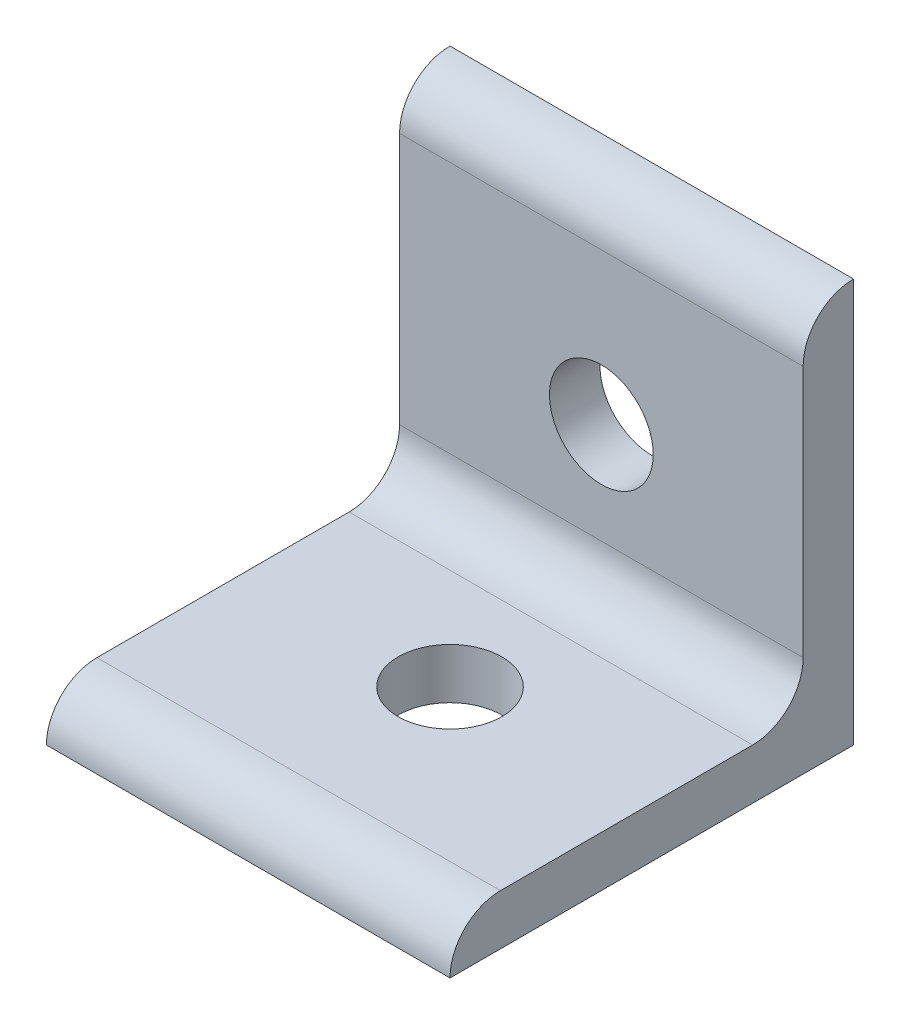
ISO-10303-21;
HEADER;
FILE_DESCRIPTION(('STEP AP214'),'2;1');
FILE_NAME('part.step','',(''),(''),'','','');
FILE_SCHEMA(('AUTOMOTIVE_DESIGN { 1 0 10303 214 1 1 1 1 }'));
ENDSEC;
DATA;
#1=APPLICATION_CONTEXT('core data for automotive mechanical design processes');
#2=APPLICATION_PROTOCOL_DEFINITION('international standard','automotive_design',2000,#1);
#3=PRODUCT_CONTEXT('',#1,'mechanical');
#4=PRODUCT('Part','Part','',(#3));
#5=PRODUCT_RELATED_PRODUCT_CATEGORY('part','',(#4));
#6=PRODUCT_DEFINITION_FORMATION('','',#4);
#7=PRODUCT_DEFINITION_CONTEXT('part definition',#1,'design');
#8=PRODUCT_DEFINITION('design','',#6,#7);
#9=PRODUCT_DEFINITION_SHAPE('','',#8);
#10=(LENGTH_UNIT() NAMED_UNIT(*) SI_UNIT(.MILLI.,.METRE.));
#11=(NAMED_UNIT(*) PLANE_ANGLE_UNIT() SI_UNIT($,.RADIAN.));
#12=(NAMED_UNIT(*) SI_UNIT($,.STERADIAN.) SOLID_ANGLE_UNIT());
#13=UNCERTAINTY_MEASURE_WITH_UNIT(LENGTH_MEASURE(1.E-05),#10,'distance_accuracy_value','');
#14=(GEOMETRIC_REPRESENTATION_CONTEXT(3) GLOBAL_UNCERTAINTY_ASSIGNED_CONTEXT((#13)) GLOBAL_UNIT_ASSIGNED_CONTEXT((#10,
#11,#12)) REPRESENTATION_CONTEXT('',''));
#15=CARTESIAN_POINT('',(0.,0.,0.));
#16=DIRECTION('',(0.,0.,1.));
#17=DIRECTION('',(1.,0.,0.));
#18=AXIS2_PLACEMENT_3D('',#15,#16,#17);
#19=CARTESIAN_POINT('',(12.7,0.,25.4));
#20=DIRECTION('',(0.,1.,0.));
#21=DIRECTION('',(0.,0.,1.));
#22=AXIS2_PLACEMENT_3D('',#19,#20,#21);
#23=PLANE('',#22);
#24=DIRECTION('',(-1.,0.,0.));
#25=VECTOR('',#24,1.);
#26=CARTESIAN_POINT('',(12.7,0.,25.4));
#27=LINE('',#26,#25);
#28=CARTESIAN_POINT('',(12.7,0.,25.4));
#29=VERTEX_POINT('',#28);
#30=CARTESIAN_POINT('',(-12.7,0.,25.4));
#31=VERTEX_POINT('',#30);
#32=EDGE_CURVE('E11',#29,#31,#27,.T.);
#33=ORIENTED_EDGE('',*,*,#32,.T.);
#34=DIRECTION('',(0.,0.,-1.));
#35=VECTOR('',#34,1.);
#36=CARTESIAN_POINT('',(-12.7,0.,25.4));
#37=LINE('',#36,#35);
#38=CARTESIAN_POINT('',(-12.7,0.,0.));
#39=VERTEX_POINT('',#38);
#40=EDGE_CURVE('E96',#31,#39,#37,.T.);
#41=ORIENTED_EDGE('',*,*,#40,.T.);
#42=DIRECTION('',(-1.,0.,0.));
#43=VECTOR('',#42,1.);
#44=CARTESIAN_POINT('',(12.7,0.,0.));
#45=LINE('',#44,#43);
#46=CARTESIAN_POINT('',(12.7,0.,0.));
#47=VERTEX_POINT('',#46);
#48=EDGE_CURVE('E43',#47,#39,#45,.T.);
#49=ORIENTED_EDGE('',*,*,#48,.F.);
#50=DIRECTION('',(0.,0.,-1.));
#51=VECTOR('',#50,1.);
#52=CARTESIAN_POINT('',(12.7,0.,25.4));
#53=LINE('',#52,#51);
#54=EDGE_CURVE('E97',#29,#47,#53,.T.);
#55=ORIENTED_EDGE('',*,*,#54,.F.);
#56=EDGE_LOOP('',(#33,#41,#49,#55));
#57=FACE_BOUND('',#56,.T.);
#58=CARTESIAN_POINT('',(0.,0.,12.7));
#59=DIRECTION('',(0.,1.,0.));
#60=DIRECTION('',(0.,0.,1.));
#61=AXIS2_PLACEMENT_3D('',#58,#59,#60);
#62=CIRCLE('',#61,3.2639);
#63=CARTESIAN_POINT('',(0.,0.,15.9639));
#64=VERTEX_POINT('',#63);
#65=EDGE_CURVE('E179',#64,#64,#62,.T.);
#66=ORIENTED_EDGE('',*,*,#65,.T.);
#67=EDGE_LOOP('',(#66));
#68=FACE_BOUND('',#67,.T.);
#69=ADVANCED_FACE('F35',(#57,#68),#23,.F.);
#70=CARTESIAN_POINT('',(12.7,3.175,6.35));
#71=DIRECTION('',(0.,-1.,0.));
#72=DIRECTION('',(0.,0.,-1.));
#73=AXIS2_PLACEMENT_3D('',#70,#71,#72);
#74=PLANE('',#73);
#75=DIRECTION('',(-1.,0.,0.));
#76=VECTOR('',#75,1.);
#77=CARTESIAN_POINT('',(12.7,3.175,6.35));
#78=LINE('',#77,#76);
#79=CARTESIAN_POINT('',(12.7,3.175,6.35));
#80=VERTEX_POINT('',#79);
#81=CARTESIAN_POINT('',(-12.7,3.175,6.35));
#82=VERTEX_POINT('',#81);
#83=EDGE_CURVE('E144',#80,#82,#78,.T.);
#84=ORIENTED_EDGE('',*,*,#83,.T.);
#85=DIRECTION('',(0.,0.,1.));
#86=VECTOR('',#85,1.);
#87=CARTESIAN_POINT('',(-12.7,3.175,6.35));
#88=LINE('',#87,#86);
#89=CARTESIAN_POINT('',(-12.7,3.175,22.225));
#90=VERTEX_POINT('',#89);
#91=EDGE_CURVE('E130',#82,#90,#88,.T.);
#92=ORIENTED_EDGE('',*,*,#91,.T.);
#93=DIRECTION('',(-1.,0.,0.));
#94=VECTOR('',#93,1.);
#95=CARTESIAN_POINT('',(12.7,3.175,22.225));
#96=LINE('',#95,#94);
#97=CARTESIAN_POINT('',(12.7,3.175,22.225));
#98=VERTEX_POINT('',#97);
#99=EDGE_CURVE('E112',#98,#90,#96,.T.);
#100=ORIENTED_EDGE('',*,*,#99,.F.);
#101=DIRECTION('',(0.,0.,1.));
#102=VECTOR('',#101,1.);
#103=CARTESIAN_POINT('',(12.7,3.175,6.35));
#104=LINE('',#103,#102);
#105=EDGE_CURVE('E50',#80,#98,#104,.T.);
#106=ORIENTED_EDGE('',*,*,#105,.F.);
#107=EDGE_LOOP('',(#84,#92,#100,#106));
#108=FACE_BOUND('',#107,.T.);
#109=CARTESIAN_POINT('',(0.,3.175,12.7));
#110=DIRECTION('',(0.,1.,0.));
#111=DIRECTION('',(0.,0.,1.));
#112=AXIS2_PLACEMENT_3D('',#109,#110,#111);
#113=CIRCLE('',#112,3.2639);
#114=CARTESIAN_POINT('',(0.,3.175,15.9639));
#115=VERTEX_POINT('',#114);
#116=EDGE_CURVE('E177',#115,#115,#113,.T.);
#117=ORIENTED_EDGE('',*,*,#116,.F.);
#118=EDGE_LOOP('',(#117));
#119=FACE_BOUND('',#118,.T.);
#120=ADVANCED_FACE('F171',(#108,#119),#74,.F.);
#121=CARTESIAN_POINT('',(12.7,0.,0.));
#122=DIRECTION('',(0.,0.,1.));
#123=DIRECTION('',(1.,0.,0.));
#124=AXIS2_PLACEMENT_3D('',#121,#122,#123);
#125=PLANE('',#124);
#126=ORIENTED_EDGE('',*,*,#48,.T.);
#127=DIRECTION('',(0.,1.,0.));
#128=VECTOR('',#127,1.);
#129=CARTESIAN_POINT('',(-12.7,0.,0.));
#130=LINE('',#129,#128);
#131=CARTESIAN_POINT('',(-12.7,25.4,0.));
#132=VERTEX_POINT('',#131);
#133=EDGE_CURVE('E110',#39,#132,#130,.T.);
#134=ORIENTED_EDGE('',*,*,#133,.T.);
#135=DIRECTION('',(-1.,0.,0.));
#136=VECTOR('',#135,1.);
#137=CARTESIAN_POINT('',(12.7,25.4,0.));
#138=LINE('',#137,#136);
#139=CARTESIAN_POINT('',(12.7,25.4,0.));
#140=VERTEX_POINT('',#139);
#141=EDGE_CURVE('E150',#140,#132,#138,.T.);
#142=ORIENTED_EDGE('',*,*,#141,.F.);
#143=DIRECTION('',(0.,1.,0.));
#144=VECTOR('',#143,1.);
#145=CARTESIAN_POINT('',(12.7,0.,0.));
#146=LINE('',#145,#144);
#147=EDGE_CURVE('E135',#47,#140,#146,.T.);
#148=ORIENTED_EDGE('',*,*,#147,.F.);
#149=EDGE_LOOP('',(#126,#134,#142,#148));
#150=FACE_BOUND('',#149,.T.);
#151=CARTESIAN_POINT('',(0.,12.7,0.));
#152=DIRECTION('',(0.,0.,1.));
#153=DIRECTION('',(1.,0.,0.));
#154=AXIS2_PLACEMENT_3D('',#151,#152,#153);
#155=CIRCLE('',#154,3.2639);
#156=CARTESIAN_POINT('',(3.2639,12.7,0.));
#157=VERTEX_POINT('',#156);
#158=EDGE_CURVE('E116',#157,#157,#155,.T.);
#159=ORIENTED_EDGE('',*,*,#158,.T.);
#160=EDGE_LOOP('',(#159));
#161=FACE_BOUND('',#160,.T.);
#162=ADVANCED_FACE('F153',(#150,#161),#125,.F.);
#163=CARTESIAN_POINT('',(12.7,22.225,3.175));
#164=DIRECTION('',(0.,0.,-1.));
#165=DIRECTION('',(-1.,0.,0.));
#166=AXIS2_PLACEMENT_3D('',#163,#164,#165);
#167=PLANE('',#166);
#168=DIRECTION('',(-1.,0.,0.));
#169=VECTOR('',#168,1.);
#170=CARTESIAN_POINT('',(12.7,22.225,3.175));
#171=LINE('',#170,#169);
#172=CARTESIAN_POINT('',(12.7,22.225,3.175));
#173=VERTEX_POINT('',#172);
#174=CARTESIAN_POINT('',(-12.7,22.225,3.175));
#175=VERTEX_POINT('',#174);
#176=EDGE_CURVE('E148',#173,#175,#171,.T.);
#177=ORIENTED_EDGE('',*,*,#176,.T.);
#178=DIRECTION('',(0.,-1.,0.));
#179=VECTOR('',#178,1.);
#180=CARTESIAN_POINT('',(-12.7,22.225,3.175));
#181=LINE('',#180,#179);
#182=CARTESIAN_POINT('',(-12.7,6.35,3.175));
#183=VERTEX_POINT('',#182);
#184=EDGE_CURVE('E124',#175,#183,#181,.T.);
#185=ORIENTED_EDGE('',*,*,#184,.T.);
#186=DIRECTION('',(-1.,0.,0.));
#187=VECTOR('',#186,1.);
#188=CARTESIAN_POINT('',(12.7,6.35,3.175));
#189=LINE('',#188,#187);
#190=CARTESIAN_POINT('',(12.7,6.35,3.175));
#191=VERTEX_POINT('',#190);
#192=EDGE_CURVE('E146',#191,#183,#189,.T.);
#193=ORIENTED_EDGE('',*,*,#192,.F.);
#194=DIRECTION('',(0.,-1.,0.));
#195=VECTOR('',#194,1.);
#196=CARTESIAN_POINT('',(12.7,22.225,3.175));
#197=LINE('',#196,#195);
#198=EDGE_CURVE('E139',#173,#191,#197,.T.);
#199=ORIENTED_EDGE('',*,*,#198,.F.);
#200=EDGE_LOOP('',(#177,#185,#193,#199));
#201=FACE_BOUND('',#200,.T.);
#202=CARTESIAN_POINT('',(0.,12.7,3.175));
#203=DIRECTION('',(0.,0.,1.));
#204=DIRECTION('',(1.,0.,0.));
#205=AXIS2_PLACEMENT_3D('',#202,#203,#204);
#206=CIRCLE('',#205,3.2639);
#207=CARTESIAN_POINT('',(3.2639,12.7,3.175));
#208=VERTEX_POINT('',#207);
#209=EDGE_CURVE('E113',#208,#208,#206,.T.);
#210=ORIENTED_EDGE('',*,*,#209,.F.);
#211=EDGE_LOOP('',(#210));
#212=FACE_BOUND('',#211,.T.);
#213=ADVANCED_FACE('F165',(#201,#212),#167,.F.);
#214=CARTESIAN_POINT('',(12.7,-4.73145828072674E-13,22.2249999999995));
#215=DIRECTION('',(-1.,0.,0.));
#216=DIRECTION('',(0.,0.,1.));
#217=AXIS2_PLACEMENT_3D('',#214,#215,#216);
#218=CYLINDRICAL_SURFACE('',#217,3.17500000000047);
#219=ORIENTED_EDGE('',*,*,#99,.T.);
#220=CARTESIAN_POINT('',(-12.7,-4.73145828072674E-13,22.2249999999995));
#221=DIRECTION('',(1.,0.,0.));
#222=DIRECTION('',(0.,0.,-1.));
#223=AXIS2_PLACEMENT_3D('',#220,#221,#222);
#224=CIRCLE('',#223,3.17500000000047);
#225=EDGE_CURVE('E106',#90,#31,#224,.T.);
#226=ORIENTED_EDGE('',*,*,#225,.T.);
#227=ORIENTED_EDGE('',*,*,#32,.F.);
#228=CARTESIAN_POINT('',(12.7,-4.73145828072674E-13,22.2249999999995));
#229=DIRECTION('',(1.,0.,0.));
#230=DIRECTION('',(0.,0.,-1.));
#231=AXIS2_PLACEMENT_3D('',#228,#229,#230);
#232=CIRCLE('',#231,3.17500000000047);
#233=EDGE_CURVE('E132',#98,#29,#232,.T.);
#234=ORIENTED_EDGE('',*,*,#233,.F.);
#235=EDGE_LOOP('',(#219,#226,#227,#234));
#236=FACE_BOUND('',#235,.T.);
#237=ADVANCED_FACE('F37',(#236),#218,.T.);
#238=CARTESIAN_POINT('',(12.7,22.2249999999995,-4.711942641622E-13));
#239=DIRECTION('',(-1.,0.,0.));
#240=DIRECTION('',(0.,0.,1.));
#241=AXIS2_PLACEMENT_3D('',#238,#239,#240);
#242=CYLINDRICAL_SURFACE('',#241,3.17500000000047);
#243=ORIENTED_EDGE('',*,*,#141,.T.);
#244=CARTESIAN_POINT('',(-12.7,22.2249999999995,-4.711942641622E-13));
#245=DIRECTION('',(1.,0.,0.));
#246=DIRECTION('',(0.,0.,-1.));
#247=AXIS2_PLACEMENT_3D('',#244,#245,#246);
#248=CIRCLE('',#247,3.17500000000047);
#249=EDGE_CURVE('E121',#132,#175,#248,.T.);
#250=ORIENTED_EDGE('',*,*,#249,.T.);
#251=ORIENTED_EDGE('',*,*,#176,.F.);
#252=CARTESIAN_POINT('',(12.7,22.2249999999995,-4.711942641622E-13));
#253=DIRECTION('',(1.,0.,0.));
#254=DIRECTION('',(0.,0.,-1.));
#255=AXIS2_PLACEMENT_3D('',#252,#253,#254);
#256=CIRCLE('',#255,3.17500000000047);
#257=EDGE_CURVE('E137',#140,#173,#256,.T.);
#258=ORIENTED_EDGE('',*,*,#257,.F.);
#259=EDGE_LOOP('',(#243,#250,#251,#258));
#260=FACE_BOUND('',#259,.T.);
#261=ADVANCED_FACE('F162',(#260),#242,.T.);
#262=CARTESIAN_POINT('',(12.7,6.34999999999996,6.34999999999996));
#263=DIRECTION('',(-1.,0.,0.));
#264=DIRECTION('',(0.,0.,1.));
#265=AXIS2_PLACEMENT_3D('',#262,#263,#264);
#266=CYLINDRICAL_SURFACE('',#265,3.17499999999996);
#267=ORIENTED_EDGE('',*,*,#192,.T.);
#268=CARTESIAN_POINT('',(-12.7,6.34999999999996,6.34999999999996));
#269=DIRECTION('',(-1.,0.,0.));
#270=DIRECTION('',(0.,0.,1.));
#271=AXIS2_PLACEMENT_3D('',#268,#269,#270);
#272=CIRCLE('',#271,3.17499999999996);
#273=EDGE_CURVE('E127',#183,#82,#272,.T.);
#274=ORIENTED_EDGE('',*,*,#273,.T.);
#275=ORIENTED_EDGE('',*,*,#83,.F.);
#276=CARTESIAN_POINT('',(12.7,6.34999999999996,6.34999999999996));
#277=DIRECTION('',(-1.,0.,0.));
#278=DIRECTION('',(0.,0.,1.));
#279=AXIS2_PLACEMENT_3D('',#276,#277,#278);
#280=CIRCLE('',#279,3.17499999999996);
#281=EDGE_CURVE('E55',#191,#80,#280,.T.);
#282=ORIENTED_EDGE('',*,*,#281,.F.);
#283=EDGE_LOOP('',(#267,#274,#275,#282));
#284=FACE_BOUND('',#283,.T.);
#285=ADVANCED_FACE('F169',(#284),#266,.F.);
#286=CARTESIAN_POINT('',(12.7,-4.73145828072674E-13,22.2249999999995));
#287=DIRECTION('',(1.,0.,0.));
#288=DIRECTION('',(0.,0.,-1.));
#289=AXIS2_PLACEMENT_3D('',#286,#287,#288);
#290=PLANE('',#289);
#291=ORIENTED_EDGE('',*,*,#233,.T.);
#292=ORIENTED_EDGE('',*,*,#54,.T.);
#293=ORIENTED_EDGE('',*,*,#147,.T.);
#294=ORIENTED_EDGE('',*,*,#257,.T.);
#295=ORIENTED_EDGE('',*,*,#198,.T.);
#296=ORIENTED_EDGE('',*,*,#281,.T.);
#297=ORIENTED_EDGE('',*,*,#105,.T.);
#298=EDGE_LOOP('',(#291,#292,#293,#294,#295,#296,#297));
#299=FACE_BOUND('',#298,.T.);
#300=ADVANCED_FACE('F157',(#299),#290,.T.);
#301=CARTESIAN_POINT('',(-12.7,-4.73145828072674E-13,22.2249999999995));
#302=DIRECTION('',(1.,0.,0.));
#303=DIRECTION('',(0.,0.,-1.));
#304=AXIS2_PLACEMENT_3D('',#301,#302,#303);
#305=PLANE('',#304);
#306=ORIENTED_EDGE('',*,*,#225,.F.);
#307=ORIENTED_EDGE('',*,*,#91,.F.);
#308=ORIENTED_EDGE('',*,*,#273,.F.);
#309=ORIENTED_EDGE('',*,*,#184,.F.);
#310=ORIENTED_EDGE('',*,*,#249,.F.);
#311=ORIENTED_EDGE('',*,*,#133,.F.);
#312=ORIENTED_EDGE('',*,*,#40,.F.);
#313=EDGE_LOOP('',(#306,#307,#308,#309,#310,#311,#312));
#314=FACE_BOUND('',#313,.T.);
#315=ADVANCED_FACE('F104',(#314),#305,.F.);
#316=CARTESIAN_POINT('',(0.,12.7,3.175));
#317=DIRECTION('',(0.,0.,-1.));
#318=DIRECTION('',(-1.,0.,0.));
#319=AXIS2_PLACEMENT_3D('',#316,#317,#318);
#320=CYLINDRICAL_SURFACE('',#319,3.2639);
#321=ORIENTED_EDGE('',*,*,#209,.T.);
#322=EDGE_LOOP('',(#321));
#323=FACE_BOUND('',#322,.T.);
#324=ORIENTED_EDGE('',*,*,#158,.F.);
#325=EDGE_LOOP('',(#324));
#326=FACE_BOUND('',#325,.T.);
#327=ADVANCED_FACE('F188',(#323,#326),#320,.F.);
#328=CARTESIAN_POINT('',(0.,3.175,12.7));
#329=DIRECTION('',(0.,-1.,0.));
#330=DIRECTION('',(0.,0.,-1.));
#331=AXIS2_PLACEMENT_3D('',#328,#329,#330);
#332=CYLINDRICAL_SURFACE('',#331,3.2639);
#333=ORIENTED_EDGE('',*,*,#116,.T.);
#334=EDGE_LOOP('',(#333));
#335=FACE_BOUND('',#334,.T.);
#336=ORIENTED_EDGE('',*,*,#65,.F.);
#337=EDGE_LOOP('',(#336));
#338=FACE_BOUND('',#337,.T.);
#339=ADVANCED_FACE('F186',(#335,#338),#332,.F.);
#340=CLOSED_SHELL('',(#69,#120,#162,#213,#237,#261,#285,#300,#315,#327,#339));
#341=MANIFOLD_SOLID_BREP('B2',#340);
#342=ADVANCED_BREP_SHAPE_REPRESENTATION('',(#18,#341),#14);
#343=SHAPE_DEFINITION_REPRESENTATION(#9,#342);
ENDSEC;
END-ISO-10303-21;
